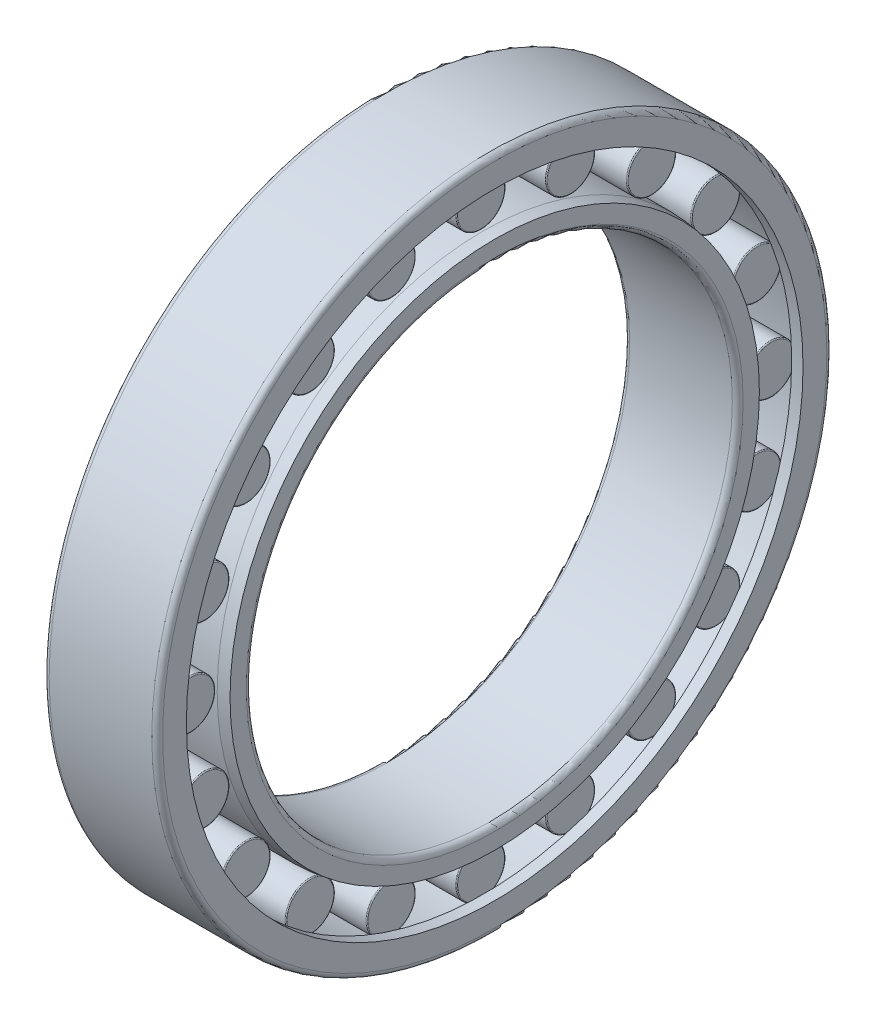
from build123d import *

# Parameters (mm, degrees)
ROLLERSDETAILED_COUNT = 20
ROLLERSDETAILED_ANGLE = 342


with BuildPart() as part:
    # OutRacSke → OuterRace (revolve)
    with BuildSketch(Plane.XY, mode=Mode.PRIVATE) as outerrace_sk:
        with BuildLine():
            Line((-16.8, 114.18875), (-21, 114.18875))
            Line((-21, 114.18875), (-21, 123))
            ThreePointArc((-21, 123), (-20.414213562, 124.414213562), (-19, 125))
            Line((-19, 125), (19, 125))
            ThreePointArc((19, 125), (20.414213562, 124.414213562), (21, 123))
            Line((21, 123), (21, 114.18875))
            Line((21, 114.18875), (16.8, 114.18875))
            Line((16.8, 114.18875), (16.8, 116.42))
            Line((16.8, 116.42), (-16.8, 116.42))
            Line((-16.8, 116.42), (-16.8, 114.18875))
        make_face()
    revolve(outerrace_sk.sketch.rotate(Axis((-90, 0, 0), (1, 0, 0)), 270), axis=Axis((-90, 0, 0), (1, 0, 0)))

    # RolDetSke → RollerDetailed (revolve)
    with BuildSketch(Plane.XY, mode=Mode.PRIVATE) as rollerdetailed_sk:
        with BuildLine():
            Line((-15.96, 116.18512), (-15.96, 107.5))
            Line((-15.96, 107.5), (15.96, 107.5))
            Line((15.96, 107.5), (15.96, 116.18512))
            ThreePointArc((15.96, 116.18512), (15.854007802, 116.441007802), (15.59812, 116.547))
            Line((15.59812, 116.547), (-15.59812, 116.547))
            ThreePointArc((-15.59812, 116.547), (-15.854007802, 116.441007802), (-15.96, 116.18512))
        make_face()
    rollerdetailed = revolve(rollerdetailed_sk.sketch.rotate(Axis((-33.6, 107.5, 0), (1, 0, 0)), 270), axis=Axis((-33.6, 107.5, 0), (1, 0, 0)))

    # InsRacSke → InnerRace (revolve)
    with BuildSketch(Plane.XY, mode=Mode.PRIVATE) as innerrace_sk:
        with BuildLine():
            Line((-16.8, 98.58), (-21, 98.0221875))
            Line((-21, 98.0221875), (-21, 92))
            ThreePointArc((-21, 92), (-20.414213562, 90.585786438), (-19, 90))
            Line((-19, 90), (19, 90))
            ThreePointArc((19, 90), (20.414213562, 90.585786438), (21, 92))
            Line((21, 92), (21, 98.0221875))
            Line((21, 98.0221875), (16.8, 98.58))
            Line((16.8, 98.58), (-16.8, 98.58))
        make_face()
    revolve(innerrace_sk.sketch.rotate(Axis((-90, 0, 0), (1, 0, 0)), 270), axis=Axis((-90, 0, 0), (1, 0, 0)))

    # RollersDetailed: RollerDetailed ×20 about axis
    rollersdetailed_axis = Axis((-50, 0, 0), (1, 0, 0))
    for i in range(1, ROLLERSDETAILED_COUNT):
        add(rollerdetailed.rotate(rollersdetailed_axis, i * ROLLERSDETAILED_ANGLE / (ROLLERSDETAILED_COUNT - 1)))


solid = part.part
